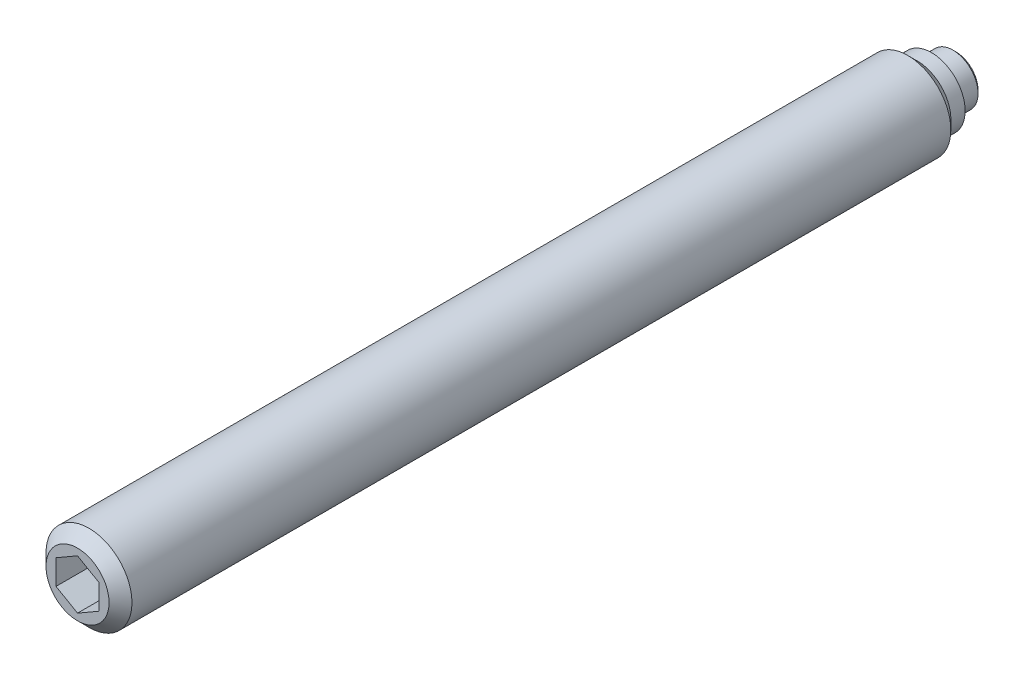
ISO-10303-21;
HEADER;
FILE_DESCRIPTION(('STEP AP214'),'2;1');
FILE_NAME('part.step','',(''),(''),'','','');
FILE_SCHEMA(('AUTOMOTIVE_DESIGN { 1 0 10303 214 1 1 1 1 }'));
ENDSEC;
DATA;
#1=APPLICATION_CONTEXT('core data for automotive mechanical design processes');
#2=APPLICATION_PROTOCOL_DEFINITION('international standard','automotive_design',2000,#1);
#3=PRODUCT_CONTEXT('',#1,'mechanical');
#4=PRODUCT('Part','Part','',(#3));
#5=PRODUCT_RELATED_PRODUCT_CATEGORY('part','',(#4));
#6=PRODUCT_DEFINITION_FORMATION('','',#4);
#7=PRODUCT_DEFINITION_CONTEXT('part definition',#1,'design');
#8=PRODUCT_DEFINITION('design','',#6,#7);
#9=PRODUCT_DEFINITION_SHAPE('','',#8);
#10=(LENGTH_UNIT() NAMED_UNIT(*) SI_UNIT(.MILLI.,.METRE.));
#11=(NAMED_UNIT(*) PLANE_ANGLE_UNIT() SI_UNIT($,.RADIAN.));
#12=(NAMED_UNIT(*) SI_UNIT($,.STERADIAN.) SOLID_ANGLE_UNIT());
#13=UNCERTAINTY_MEASURE_WITH_UNIT(LENGTH_MEASURE(1.E-05),#10,'distance_accuracy_value','');
#14=(GEOMETRIC_REPRESENTATION_CONTEXT(3) GLOBAL_UNCERTAINTY_ASSIGNED_CONTEXT((#13)) GLOBAL_UNIT_ASSIGNED_CONTEXT((#10,
#11,#12)) REPRESENTATION_CONTEXT('',''));
#15=CARTESIAN_POINT('',(0.,0.,0.));
#16=DIRECTION('',(0.,0.,1.));
#17=DIRECTION('',(1.,0.,0.));
#18=AXIS2_PLACEMENT_3D('',#15,#16,#17);
#19=CARTESIAN_POINT('',(0.,0.,0.));
#20=DIRECTION('',(0.,0.,-1.));
#21=DIRECTION('',(-1.,0.,0.));
#22=AXIS2_PLACEMENT_3D('',#19,#20,#21);
#23=CYLINDRICAL_SURFACE('',#22,1.75);
#24=CARTESIAN_POINT('',(0.,0.,0.2));
#25=DIRECTION('',(0.,0.,-1.));
#26=DIRECTION('',(-1.,0.,0.));
#27=AXIS2_PLACEMENT_3D('',#24,#25,#26);
#28=CIRCLE('',#27,1.75);
#29=CARTESIAN_POINT('',(-1.75,0.,0.2));
#30=VERTEX_POINT('',#29);
#31=EDGE_CURVE('E133',#30,#30,#28,.T.);
#32=ORIENTED_EDGE('',*,*,#31,.F.);
#33=EDGE_LOOP('',(#32));
#34=FACE_BOUND('',#33,.T.);
#35=CARTESIAN_POINT('',(0.,0.,1.7));
#36=DIRECTION('',(0.,0.,-1.));
#37=DIRECTION('',(-1.,0.,0.));
#38=AXIS2_PLACEMENT_3D('',#35,#36,#37);
#39=CIRCLE('',#38,1.75);
#40=CARTESIAN_POINT('',(-1.75,0.,1.7));
#41=VERTEX_POINT('',#40);
#42=EDGE_CURVE('E127',#41,#41,#39,.T.);
#43=ORIENTED_EDGE('',*,*,#42,.T.);
#44=EDGE_LOOP('',(#43));
#45=FACE_BOUND('',#44,.T.);
#46=ADVANCED_FACE('F14',(#34,#45),#23,.T.);
#47=CARTESIAN_POINT('',(0.,0.,0.2));
#48=DIRECTION('',(0.,0.,1.));
#49=DIRECTION('',(1.,0.,0.));
#50=AXIS2_PLACEMENT_3D('',#47,#48,#49);
#51=CONICAL_SURFACE('',#50,1.75,0.785398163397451);
#52=CARTESIAN_POINT('',(0.,0.,0.));
#53=DIRECTION('',(0.,0.,-1.));
#54=DIRECTION('',(-1.,0.,0.));
#55=AXIS2_PLACEMENT_3D('',#52,#53,#54);
#56=CIRCLE('',#55,1.55);
#57=CARTESIAN_POINT('',(-1.55,0.,0.));
#58=VERTEX_POINT('',#57);
#59=EDGE_CURVE('E130',#58,#58,#56,.T.);
#60=ORIENTED_EDGE('',*,*,#59,.F.);
#61=EDGE_LOOP('',(#60));
#62=FACE_BOUND('',#61,.T.);
#63=ORIENTED_EDGE('',*,*,#31,.T.);
#64=EDGE_LOOP('',(#63));
#65=FACE_BOUND('',#64,.T.);
#66=ADVANCED_FACE('F159',(#62,#65),#51,.T.);
#67=CARTESIAN_POINT('',(0.,1.55,0.));
#68=DIRECTION('',(0.,0.,1.));
#69=DIRECTION('',(1.,0.,0.));
#70=AXIS2_PLACEMENT_3D('',#67,#68,#69);
#71=PLANE('',#70);
#72=ORIENTED_EDGE('',*,*,#59,.T.);
#73=EDGE_LOOP('',(#72));
#74=FACE_BOUND('',#73,.T.);
#75=ADVANCED_FACE('F165',(#74),#71,.F.);
#76=CARTESIAN_POINT('',(0.,0.,1.7));
#77=DIRECTION('',(0.,0.,-1.));
#78=DIRECTION('',(-1.,0.,0.));
#79=AXIS2_PLACEMENT_3D('',#76,#77,#78);
#80=CYLINDRICAL_SURFACE('',#79,3.);
#81=CARTESIAN_POINT('',(0.,0.,3.35));
#82=DIRECTION('',(0.,0.,-1.));
#83=DIRECTION('',(-1.,0.,0.));
#84=AXIS2_PLACEMENT_3D('',#81,#82,#83);
#85=CIRCLE('',#84,3.);
#86=CARTESIAN_POINT('',(-3.,0.,3.35));
#87=VERTEX_POINT('',#86);
#88=EDGE_CURVE('E9',#87,#87,#85,.T.);
#89=ORIENTED_EDGE('',*,*,#88,.F.);
#90=EDGE_LOOP('',(#89));
#91=FACE_BOUND('',#90,.T.);
#92=CARTESIAN_POINT('',(0.,0.,60.5));
#93=DIRECTION('',(0.,0.,1.));
#94=DIRECTION('',(1.,0.,0.));
#95=AXIS2_PLACEMENT_3D('',#92,#93,#94);
#96=CIRCLE('',#95,3.);
#97=CARTESIAN_POINT('',(3.,0.,60.5));
#98=VERTEX_POINT('',#97);
#99=EDGE_CURVE('E124',#98,#98,#96,.T.);
#100=ORIENTED_EDGE('',*,*,#99,.F.);
#101=EDGE_LOOP('',(#100));
#102=FACE_BOUND('',#101,.T.);
#103=ADVANCED_FACE('F16',(#91,#102),#80,.T.);
#104=CARTESIAN_POINT('',(0.,2.35,1.7));
#105=DIRECTION('',(0.,0.,1.));
#106=DIRECTION('',(1.,0.,0.));
#107=AXIS2_PLACEMENT_3D('',#104,#105,#106);
#108=PLANE('',#107);
#109=CARTESIAN_POINT('',(0.,0.,1.7));
#110=DIRECTION('',(0.,0.,-1.));
#111=DIRECTION('',(-1.,0.,0.));
#112=AXIS2_PLACEMENT_3D('',#109,#110,#111);
#113=CIRCLE('',#112,2.35);
#114=CARTESIAN_POINT('',(-2.35,0.,1.7));
#115=VERTEX_POINT('',#114);
#116=EDGE_CURVE('E136',#115,#115,#113,.T.);
#117=ORIENTED_EDGE('',*,*,#116,.T.);
#118=EDGE_LOOP('',(#117));
#119=FACE_BOUND('',#118,.T.);
#120=ORIENTED_EDGE('',*,*,#42,.F.);
#121=EDGE_LOOP('',(#120));
#122=FACE_BOUND('',#121,.T.);
#123=ADVANCED_FACE('F156',(#119,#122),#108,.F.);
#124=CARTESIAN_POINT('',(0.,0.,1.7));
#125=DIRECTION('',(0.,0.,-1.));
#126=DIRECTION('',(-1.,0.,0.));
#127=AXIS2_PLACEMENT_3D('',#124,#125,#126);
#128=CYLINDRICAL_SURFACE('',#127,2.35);
#129=CARTESIAN_POINT('',(0.,0.,2.7));
#130=DIRECTION('',(0.,0.,-1.));
#131=DIRECTION('',(-1.,0.,0.));
#132=AXIS2_PLACEMENT_3D('',#129,#130,#131);
#133=CIRCLE('',#132,2.35);
#134=CARTESIAN_POINT('',(-2.35,0.,2.7));
#135=VERTEX_POINT('',#134);
#136=EDGE_CURVE('E22',#135,#135,#133,.T.);
#137=ORIENTED_EDGE('',*,*,#136,.T.);
#138=EDGE_LOOP('',(#137));
#139=FACE_BOUND('',#138,.T.);
#140=ORIENTED_EDGE('',*,*,#116,.F.);
#141=EDGE_LOOP('',(#140));
#142=FACE_BOUND('',#141,.T.);
#143=ADVANCED_FACE('F141',(#139,#142),#128,.T.);
#144=CARTESIAN_POINT('',(0.,0.,3.35));
#145=DIRECTION('',(0.,0.,1.));
#146=DIRECTION('',(1.,0.,0.));
#147=AXIS2_PLACEMENT_3D('',#144,#145,#146);
#148=CONICAL_SURFACE('',#147,3.,0.785398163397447);
#149=ORIENTED_EDGE('',*,*,#88,.T.);
#150=EDGE_LOOP('',(#149));
#151=FACE_BOUND('',#150,.T.);
#152=ORIENTED_EDGE('',*,*,#136,.F.);
#153=EDGE_LOOP('',(#152));
#154=FACE_BOUND('',#153,.T.);
#155=ADVANCED_FACE('F144',(#151,#154),#148,.T.);
#156=CARTESIAN_POINT('',(0.,-2.2,61.3));
#157=DIRECTION('',(0.,0.,1.));
#158=DIRECTION('',(1.,0.,0.));
#159=AXIS2_PLACEMENT_3D('',#156,#157,#158);
#160=PLANE('',#159);
#161=DIRECTION('',(0.866025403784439,-0.5,0.));
#162=VECTOR('',#161,1.);
#163=CARTESIAN_POINT('',(-1.5,-0.866025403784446,61.3));
#164=LINE('',#163,#162);
#165=CARTESIAN_POINT('',(-1.5,-0.866025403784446,61.3));
#166=VERTEX_POINT('',#165);
#167=CARTESIAN_POINT('',(0.,-1.73205080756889,61.3));
#168=VERTEX_POINT('',#167);
#169=EDGE_CURVE('E29',#166,#168,#164,.T.);
#170=ORIENTED_EDGE('',*,*,#169,.F.);
#171=DIRECTION('',(0.,-1.,0.));
#172=VECTOR('',#171,1.);
#173=CARTESIAN_POINT('',(-1.5,0.866025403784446,61.3));
#174=LINE('',#173,#172);
#175=CARTESIAN_POINT('',(-1.5,0.866025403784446,61.3));
#176=VERTEX_POINT('',#175);
#177=EDGE_CURVE('E112',#176,#166,#174,.T.);
#178=ORIENTED_EDGE('',*,*,#177,.F.);
#179=DIRECTION('',(-0.866025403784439,-0.5,0.));
#180=VECTOR('',#179,1.);
#181=CARTESIAN_POINT('',(0.,1.73205080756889,61.3));
#182=LINE('',#181,#180);
#183=CARTESIAN_POINT('',(0.,1.73205080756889,61.3));
#184=VERTEX_POINT('',#183);
#185=EDGE_CURVE('E110',#184,#176,#182,.T.);
#186=ORIENTED_EDGE('',*,*,#185,.F.);
#187=DIRECTION('',(-0.866025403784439,0.5,0.));
#188=VECTOR('',#187,1.);
#189=CARTESIAN_POINT('',(1.5,0.866025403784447,61.3));
#190=LINE('',#189,#188);
#191=CARTESIAN_POINT('',(1.5,0.866025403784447,61.3));
#192=VERTEX_POINT('',#191);
#193=EDGE_CURVE('E77',#192,#184,#190,.T.);
#194=ORIENTED_EDGE('',*,*,#193,.F.);
#195=DIRECTION('',(0.,1.,0.));
#196=VECTOR('',#195,1.);
#197=CARTESIAN_POINT('',(1.5,-0.866025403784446,61.3));
#198=LINE('',#197,#196);
#199=CARTESIAN_POINT('',(1.5,-0.866025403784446,61.3));
#200=VERTEX_POINT('',#199);
#201=EDGE_CURVE('E106',#200,#192,#198,.T.);
#202=ORIENTED_EDGE('',*,*,#201,.F.);
#203=DIRECTION('',(0.866025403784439,0.5,0.));
#204=VECTOR('',#203,1.);
#205=CARTESIAN_POINT('',(0.,-1.73205080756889,61.3));
#206=LINE('',#205,#204);
#207=EDGE_CURVE('E103',#168,#200,#206,.T.);
#208=ORIENTED_EDGE('',*,*,#207,.F.);
#209=EDGE_LOOP('',(#170,#178,#186,#194,#202,#208));
#210=FACE_BOUND('',#209,.T.);
#211=CARTESIAN_POINT('',(0.,0.,61.3));
#212=DIRECTION('',(0.,0.,1.));
#213=DIRECTION('',(1.,0.,0.));
#214=AXIS2_PLACEMENT_3D('',#211,#212,#213);
#215=CIRCLE('',#214,2.2);
#216=CARTESIAN_POINT('',(2.2,0.,61.3));
#217=VERTEX_POINT('',#216);
#218=EDGE_CURVE('E116',#217,#217,#215,.T.);
#219=ORIENTED_EDGE('',*,*,#218,.T.);
#220=EDGE_LOOP('',(#219));
#221=FACE_BOUND('',#220,.T.);
#222=ADVANCED_FACE('F146',(#210,#221),#160,.T.);
#223=CARTESIAN_POINT('',(0.,0.,61.3));
#224=DIRECTION('',(0.,0.,-1.));
#225=DIRECTION('',(-1.,0.,0.));
#226=AXIS2_PLACEMENT_3D('',#223,#224,#225);
#227=CONICAL_SURFACE('',#226,2.2,0.785398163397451);
#228=ORIENTED_EDGE('',*,*,#99,.T.);
#229=EDGE_LOOP('',(#228));
#230=FACE_BOUND('',#229,.T.);
#231=ORIENTED_EDGE('',*,*,#218,.F.);
#232=EDGE_LOOP('',(#231));
#233=FACE_BOUND('',#232,.T.);
#234=ADVANCED_FACE('F153',(#230,#233),#227,.T.);
#235=CARTESIAN_POINT('',(-1.5,-0.866025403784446,57.8));
#236=DIRECTION('',(-0.5,-0.866025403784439,0.));
#237=DIRECTION('',(0.866025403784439,-0.5,0.));
#238=AXIS2_PLACEMENT_3D('',#235,#236,#237);
#239=PLANE('',#238);
#240=ORIENTED_EDGE('',*,*,#169,.T.);
#241=DIRECTION('',(0.,0.,1.));
#242=VECTOR('',#241,1.);
#243=CARTESIAN_POINT('',(0.,-1.73205080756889,57.8));
#244=LINE('',#243,#242);
#245=CARTESIAN_POINT('',(0.,-1.73205080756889,57.8));
#246=VERTEX_POINT('',#245);
#247=EDGE_CURVE('E59',#246,#168,#244,.T.);
#248=ORIENTED_EDGE('',*,*,#247,.F.);
#249=DIRECTION('',(0.866025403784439,-0.5,0.));
#250=VECTOR('',#249,1.);
#251=CARTESIAN_POINT('',(-1.5,-0.866025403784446,57.8));
#252=LINE('',#251,#250);
#253=CARTESIAN_POINT('',(-1.5,-0.866025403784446,57.8));
#254=VERTEX_POINT('',#253);
#255=EDGE_CURVE('E114',#254,#246,#252,.T.);
#256=ORIENTED_EDGE('',*,*,#255,.F.);
#257=DIRECTION('',(0.,0.,1.));
#258=VECTOR('',#257,1.);
#259=CARTESIAN_POINT('',(-1.5,-0.866025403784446,57.8));
#260=LINE('',#259,#258);
#261=EDGE_CURVE('E37',#254,#166,#260,.T.);
#262=ORIENTED_EDGE('',*,*,#261,.T.);
#263=EDGE_LOOP('',(#240,#248,#256,#262));
#264=FACE_BOUND('',#263,.T.);
#265=ADVANCED_FACE('F191',(#264),#239,.F.);
#266=CARTESIAN_POINT('',(-1.5,0.866025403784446,57.8));
#267=DIRECTION('',(-1.,0.,0.));
#268=DIRECTION('',(0.,0.,1.));
#269=AXIS2_PLACEMENT_3D('',#266,#267,#268);
#270=PLANE('',#269);
#271=ORIENTED_EDGE('',*,*,#177,.T.);
#272=ORIENTED_EDGE('',*,*,#261,.F.);
#273=DIRECTION('',(0.,-1.,0.));
#274=VECTOR('',#273,1.);
#275=CARTESIAN_POINT('',(-1.5,0.866025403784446,57.8));
#276=LINE('',#275,#274);
#277=CARTESIAN_POINT('',(-1.5,0.866025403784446,57.8));
#278=VERTEX_POINT('',#277);
#279=EDGE_CURVE('E89',#278,#254,#276,.T.);
#280=ORIENTED_EDGE('',*,*,#279,.F.);
#281=DIRECTION('',(0.,0.,1.));
#282=VECTOR('',#281,1.);
#283=CARTESIAN_POINT('',(-1.5,0.866025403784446,57.8));
#284=LINE('',#283,#282);
#285=EDGE_CURVE('E81',#278,#176,#284,.T.);
#286=ORIENTED_EDGE('',*,*,#285,.T.);
#287=EDGE_LOOP('',(#271,#272,#280,#286));
#288=FACE_BOUND('',#287,.T.);
#289=ADVANCED_FACE('F198',(#288),#270,.F.);
#290=CARTESIAN_POINT('',(0.,1.73205080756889,57.8));
#291=DIRECTION('',(-0.5,0.866025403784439,0.));
#292=DIRECTION('',(-0.866025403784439,-0.5,0.));
#293=AXIS2_PLACEMENT_3D('',#290,#291,#292);
#294=PLANE('',#293);
#295=ORIENTED_EDGE('',*,*,#185,.T.);
#296=ORIENTED_EDGE('',*,*,#285,.F.);
#297=DIRECTION('',(-0.866025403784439,-0.5,0.));
#298=VECTOR('',#297,1.);
#299=CARTESIAN_POINT('',(0.,1.73205080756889,57.8));
#300=LINE('',#299,#298);
#301=CARTESIAN_POINT('',(0.,1.73205080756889,57.8));
#302=VERTEX_POINT('',#301);
#303=EDGE_CURVE('E85',#302,#278,#300,.T.);
#304=ORIENTED_EDGE('',*,*,#303,.F.);
#305=DIRECTION('',(0.,0.,1.));
#306=VECTOR('',#305,1.);
#307=CARTESIAN_POINT('',(0.,1.73205080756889,57.8));
#308=LINE('',#307,#306);
#309=EDGE_CURVE('E70',#302,#184,#308,.T.);
#310=ORIENTED_EDGE('',*,*,#309,.T.);
#311=EDGE_LOOP('',(#295,#296,#304,#310));
#312=FACE_BOUND('',#311,.T.);
#313=ADVANCED_FACE('F86',(#312),#294,.F.);
#314=CARTESIAN_POINT('',(1.5,0.866025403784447,57.8));
#315=DIRECTION('',(0.5,0.866025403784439,0.));
#316=DIRECTION('',(-0.866025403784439,0.5,0.));
#317=AXIS2_PLACEMENT_3D('',#314,#315,#316);
#318=PLANE('',#317);
#319=ORIENTED_EDGE('',*,*,#193,.T.);
#320=ORIENTED_EDGE('',*,*,#309,.F.);
#321=DIRECTION('',(-0.866025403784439,0.5,0.));
#322=VECTOR('',#321,1.);
#323=CARTESIAN_POINT('',(1.5,0.866025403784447,57.8));
#324=LINE('',#323,#322);
#325=CARTESIAN_POINT('',(1.5,0.866025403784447,57.8));
#326=VERTEX_POINT('',#325);
#327=EDGE_CURVE('E74',#326,#302,#324,.T.);
#328=ORIENTED_EDGE('',*,*,#327,.F.);
#329=DIRECTION('',(0.,0.,1.));
#330=VECTOR('',#329,1.);
#331=CARTESIAN_POINT('',(1.5,0.866025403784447,57.8));
#332=LINE('',#331,#330);
#333=EDGE_CURVE('E82',#326,#192,#332,.T.);
#334=ORIENTED_EDGE('',*,*,#333,.T.);
#335=EDGE_LOOP('',(#319,#320,#328,#334));
#336=FACE_BOUND('',#335,.T.);
#337=ADVANCED_FACE('F72',(#336),#318,.F.);
#338=CARTESIAN_POINT('',(1.5,-0.866025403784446,57.8));
#339=DIRECTION('',(1.,0.,0.));
#340=DIRECTION('',(0.,1.,0.));
#341=AXIS2_PLACEMENT_3D('',#338,#339,#340);
#342=PLANE('',#341);
#343=ORIENTED_EDGE('',*,*,#201,.T.);
#344=ORIENTED_EDGE('',*,*,#333,.F.);
#345=DIRECTION('',(0.,1.,0.));
#346=VECTOR('',#345,1.);
#347=CARTESIAN_POINT('',(1.5,-0.866025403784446,57.8));
#348=LINE('',#347,#346);
#349=CARTESIAN_POINT('',(1.5,-0.866025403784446,57.8));
#350=VERTEX_POINT('',#349);
#351=EDGE_CURVE('E95',#350,#326,#348,.T.);
#352=ORIENTED_EDGE('',*,*,#351,.F.);
#353=DIRECTION('',(0.,0.,1.));
#354=VECTOR('',#353,1.);
#355=CARTESIAN_POINT('',(1.5,-0.866025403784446,57.8));
#356=LINE('',#355,#354);
#357=EDGE_CURVE('E119',#350,#200,#356,.T.);
#358=ORIENTED_EDGE('',*,*,#357,.T.);
#359=EDGE_LOOP('',(#343,#344,#352,#358));
#360=FACE_BOUND('',#359,.T.);
#361=ADVANCED_FACE('F204',(#360),#342,.F.);
#362=CARTESIAN_POINT('',(0.,-1.73205080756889,57.8));
#363=DIRECTION('',(0.5,-0.866025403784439,0.));
#364=DIRECTION('',(0.866025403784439,0.5,0.));
#365=AXIS2_PLACEMENT_3D('',#362,#363,#364);
#366=PLANE('',#365);
#367=ORIENTED_EDGE('',*,*,#207,.T.);
#368=ORIENTED_EDGE('',*,*,#357,.F.);
#369=DIRECTION('',(0.866025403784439,0.5,0.));
#370=VECTOR('',#369,1.);
#371=CARTESIAN_POINT('',(0.,-1.73205080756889,57.8));
#372=LINE('',#371,#370);
#373=EDGE_CURVE('E97',#246,#350,#372,.T.);
#374=ORIENTED_EDGE('',*,*,#373,.F.);
#375=ORIENTED_EDGE('',*,*,#247,.T.);
#376=EDGE_LOOP('',(#367,#368,#374,#375));
#377=FACE_BOUND('',#376,.T.);
#378=ADVANCED_FACE('F201',(#377),#366,.F.);
#379=CARTESIAN_POINT('',(0.,0.,57.8));
#380=DIRECTION('',(0.,0.,1.));
#381=DIRECTION('',(1.,0.,0.));
#382=AXIS2_PLACEMENT_3D('',#379,#380,#381);
#383=PLANE('',#382);
#384=ORIENTED_EDGE('',*,*,#255,.T.);
#385=ORIENTED_EDGE('',*,*,#373,.T.);
#386=ORIENTED_EDGE('',*,*,#351,.T.);
#387=ORIENTED_EDGE('',*,*,#327,.T.);
#388=ORIENTED_EDGE('',*,*,#303,.T.);
#389=ORIENTED_EDGE('',*,*,#279,.T.);
#390=EDGE_LOOP('',(#384,#385,#386,#387,#388,#389));
#391=FACE_BOUND('',#390,.T.);
#392=ADVANCED_FACE('F92',(#391),#383,.T.);
#393=CLOSED_SHELL('',(#46,#66,#75,#103,#123,#143,#155,#222,#234,#265,#289,#313,#337,#361,#378,#392));
#394=MANIFOLD_SOLID_BREP('B1',#393);
#395=ADVANCED_BREP_SHAPE_REPRESENTATION('',(#18,#394),#14);
#396=SHAPE_DEFINITION_REPRESENTATION(#9,#395);
ENDSEC;
END-ISO-10303-21;
